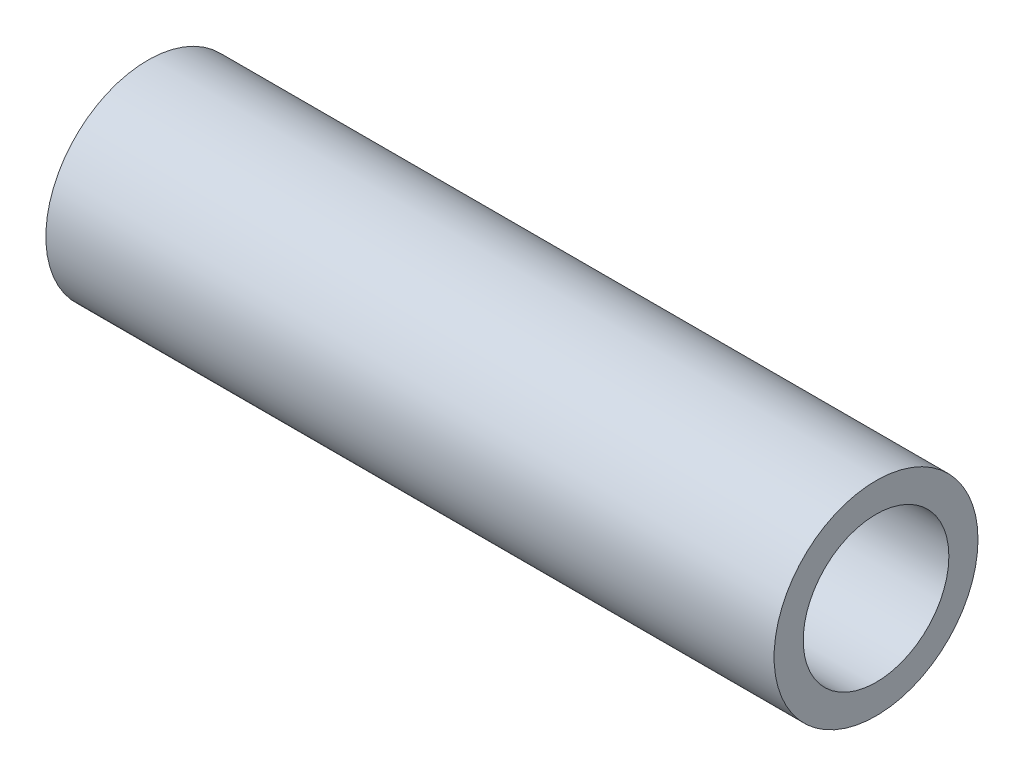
from build123d import *

# Parameters (mm, degrees)
ESQUISSE1_R          = 3.5
ESQUISSE1_R_2        = 2.5
BASE_EXTRUSION_DEPTH = 25


with BuildPart() as part:
    # Esquisse1 → Base-Extrusion (new body)
    with BuildSketch(Plane(origin=(0, 0, 0), x_dir=(0, 0, -1), z_dir=(1, 0, 0))):
        Circle(ESQUISSE1_R)
        Circle(ESQUISSE1_R_2, mode=Mode.SUBTRACT)
    extrude(amount=BASE_EXTRUSION_DEPTH)


solid = part.part
